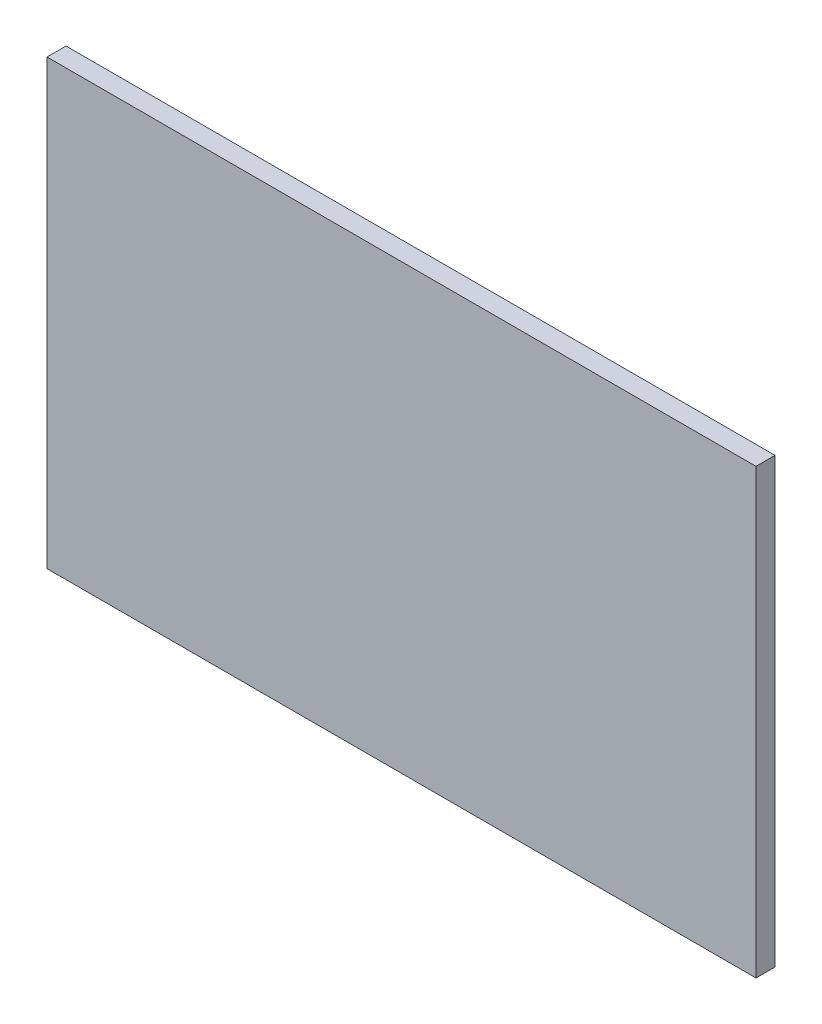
from build123d import *

# Parameters (mm, degrees)
ESQUISSE1_W          = 56
ESQUISSE1_H          = 35
BASE_EXTRUSION_DEPTH = 1.5


with BuildPart() as part:
    # Esquisse1 → Base-Extrusion (new body)
    with BuildSketch(Plane.XY):
        with Locations((28, 17.5)):
            Rectangle(ESQUISSE1_W, ESQUISSE1_H)
    extrude(amount=BASE_EXTRUSION_DEPTH)


solid = part.part
